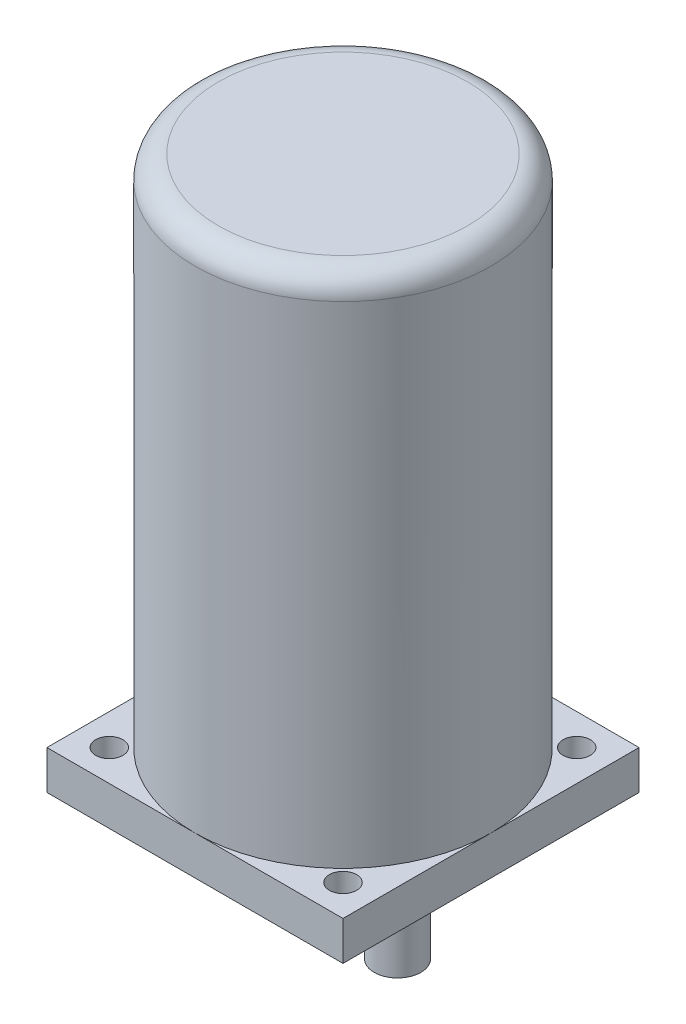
ISO-10303-21;
HEADER;
FILE_DESCRIPTION(('STEP AP214'),'2;1');
FILE_NAME('part.step','',(''),(''),'','','');
FILE_SCHEMA(('AUTOMOTIVE_DESIGN { 1 0 10303 214 1 1 1 1 }'));
ENDSEC;
DATA;
#1=APPLICATION_CONTEXT('core data for automotive mechanical design processes');
#2=APPLICATION_PROTOCOL_DEFINITION('international standard','automotive_design',2000,#1);
#3=PRODUCT_CONTEXT('',#1,'mechanical');
#4=PRODUCT('Part','Part','',(#3));
#5=PRODUCT_RELATED_PRODUCT_CATEGORY('part','',(#4));
#6=PRODUCT_DEFINITION_FORMATION('','',#4);
#7=PRODUCT_DEFINITION_CONTEXT('part definition',#1,'design');
#8=PRODUCT_DEFINITION('design','',#6,#7);
#9=PRODUCT_DEFINITION_SHAPE('','',#8);
#10=(LENGTH_UNIT() NAMED_UNIT(*) SI_UNIT(.MILLI.,.METRE.));
#11=(NAMED_UNIT(*) PLANE_ANGLE_UNIT() SI_UNIT($,.RADIAN.));
#12=(NAMED_UNIT(*) SI_UNIT($,.STERADIAN.) SOLID_ANGLE_UNIT());
#13=UNCERTAINTY_MEASURE_WITH_UNIT(LENGTH_MEASURE(1.E-05),#10,'distance_accuracy_value','');
#14=(GEOMETRIC_REPRESENTATION_CONTEXT(3) GLOBAL_UNCERTAINTY_ASSIGNED_CONTEXT((#13)) GLOBAL_UNIT_ASSIGNED_CONTEXT((#10,
#11,#12)) REPRESENTATION_CONTEXT('',''));
#15=CARTESIAN_POINT('',(0.,0.,0.));
#16=DIRECTION('',(0.,0.,1.));
#17=DIRECTION('',(1.,0.,0.));
#18=AXIS2_PLACEMENT_3D('',#15,#16,#17);
#19=CARTESIAN_POINT('',(0.,-22.,-6.99999999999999));
#20=DIRECTION('',(0.,-1.,0.));
#21=DIRECTION('',(0.,0.,-1.));
#22=AXIS2_PLACEMENT_3D('',#19,#20,#21);
#23=PLANE('',#22);
#24=CARTESIAN_POINT('',(0.,-22.,-6.99999999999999));
#25=DIRECTION('',(0.,1.,0.));
#26=DIRECTION('',(0.,0.,1.));
#27=AXIS2_PLACEMENT_3D('',#24,#25,#26);
#28=CIRCLE('',#27,3.);
#29=CARTESIAN_POINT('',(0.,-22.,-3.99999999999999));
#30=VERTEX_POINT('',#29);
#31=EDGE_CURVE('E202',#30,#30,#28,.T.);
#32=ORIENTED_EDGE('',*,*,#31,.F.);
#33=EDGE_LOOP('',(#32));
#34=FACE_BOUND('',#33,.T.);
#35=ADVANCED_FACE('F17',(#34),#23,.T.);
#36=CARTESIAN_POINT('',(0.,-22.,-6.99999999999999));
#37=DIRECTION('',(0.,1.,0.));
#38=DIRECTION('',(0.,0.,1.));
#39=AXIS2_PLACEMENT_3D('',#36,#37,#38);
#40=CYLINDRICAL_SURFACE('',#39,3.);
#41=CARTESIAN_POINT('',(0.,-7.,-6.99999999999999));
#42=DIRECTION('',(0.,1.,0.));
#43=DIRECTION('',(0.,0.,1.));
#44=AXIS2_PLACEMENT_3D('',#41,#42,#43);
#45=CIRCLE('',#44,3.);
#46=CARTESIAN_POINT('',(0.,-7.,-3.99999999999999));
#47=VERTEX_POINT('',#46);
#48=EDGE_CURVE('E200',#47,#47,#45,.T.);
#49=ORIENTED_EDGE('',*,*,#48,.F.);
#50=EDGE_LOOP('',(#49));
#51=FACE_BOUND('',#50,.T.);
#52=ORIENTED_EDGE('',*,*,#31,.T.);
#53=EDGE_LOOP('',(#52));
#54=FACE_BOUND('',#53,.T.);
#55=ADVANCED_FACE('F206',(#51,#54),#40,.T.);
#56=CARTESIAN_POINT('',(0.,-7.,-6.99999999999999));
#57=DIRECTION('',(0.,-1.,0.));
#58=DIRECTION('',(0.,0.,-1.));
#59=AXIS2_PLACEMENT_3D('',#56,#57,#58);
#60=PLANE('',#59);
#61=ORIENTED_EDGE('',*,*,#48,.T.);
#62=EDGE_LOOP('',(#61));
#63=FACE_BOUND('',#62,.T.);
#64=CARTESIAN_POINT('',(0.,-7.,-6.99999999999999));
#65=DIRECTION('',(0.,1.,0.));
#66=DIRECTION('',(0.,0.,1.));
#67=AXIS2_PLACEMENT_3D('',#64,#65,#66);
#68=CIRCLE('',#67,6.);
#69=CARTESIAN_POINT('',(0.,-7.,-0.999999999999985));
#70=VERTEX_POINT('',#69);
#71=EDGE_CURVE('E197',#70,#70,#68,.T.);
#72=ORIENTED_EDGE('',*,*,#71,.F.);
#73=EDGE_LOOP('',(#72));
#74=FACE_BOUND('',#73,.T.);
#75=ADVANCED_FACE('F213',(#63,#74),#60,.T.);
#76=CARTESIAN_POINT('',(0.,-7.,-6.99999999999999));
#77=DIRECTION('',(0.,1.,0.));
#78=DIRECTION('',(0.,0.,1.));
#79=AXIS2_PLACEMENT_3D('',#76,#77,#78);
#80=CYLINDRICAL_SURFACE('',#79,6.);
#81=ORIENTED_EDGE('',*,*,#71,.T.);
#82=EDGE_LOOP('',(#81));
#83=FACE_BOUND('',#82,.T.);
#84=CARTESIAN_POINT('',(0.,0.,-6.99999999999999));
#85=DIRECTION('',(0.,1.,0.));
#86=DIRECTION('',(0.,0.,1.));
#87=AXIS2_PLACEMENT_3D('',#84,#85,#86);
#88=CIRCLE('',#87,6.);
#89=CARTESIAN_POINT('',(0.,0.,-0.999999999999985));
#90=VERTEX_POINT('',#89);
#91=EDGE_CURVE('E194',#90,#90,#88,.F.);
#92=ORIENTED_EDGE('',*,*,#91,.T.);
#93=EDGE_LOOP('',(#92));
#94=FACE_BOUND('',#93,.T.);
#95=ADVANCED_FACE('F259',(#83,#94),#80,.T.);
#96=CARTESIAN_POINT('',(0.,0.,0.));
#97=DIRECTION('',(0.,1.,0.));
#98=DIRECTION('',(0.,0.,1.));
#99=AXIS2_PLACEMENT_3D('',#96,#97,#98);
#100=PLANE('',#99);
#101=ORIENTED_EDGE('',*,*,#91,.F.);
#102=EDGE_LOOP('',(#101));
#103=FACE_BOUND('',#102,.T.);
#104=DIRECTION('',(-1.,0.,0.));
#105=VECTOR('',#104,1.);
#106=CARTESIAN_POINT('',(-19.,0.,19.));
#107=LINE('',#106,#105);
#108=CARTESIAN_POINT('',(19.,0.,19.));
#109=VERTEX_POINT('',#108);
#110=CARTESIAN_POINT('',(-19.,0.,19.));
#111=VERTEX_POINT('',#110);
#112=EDGE_CURVE('E175',#109,#111,#107,.T.);
#113=ORIENTED_EDGE('',*,*,#112,.T.);
#114=DIRECTION('',(0.,0.,-1.));
#115=VECTOR('',#114,1.);
#116=CARTESIAN_POINT('',(-19.,0.,-19.));
#117=LINE('',#116,#115);
#118=CARTESIAN_POINT('',(-19.,0.,-19.));
#119=VERTEX_POINT('',#118);
#120=EDGE_CURVE('E187',#111,#119,#117,.T.);
#121=ORIENTED_EDGE('',*,*,#120,.T.);
#122=DIRECTION('',(1.,0.,0.));
#123=VECTOR('',#122,1.);
#124=CARTESIAN_POINT('',(-19.,0.,-19.));
#125=LINE('',#124,#123);
#126=CARTESIAN_POINT('',(19.,0.,-19.));
#127=VERTEX_POINT('',#126);
#128=EDGE_CURVE('E83',#119,#127,#125,.T.);
#129=ORIENTED_EDGE('',*,*,#128,.T.);
#130=DIRECTION('',(0.,0.,1.));
#131=VECTOR('',#130,1.);
#132=CARTESIAN_POINT('',(19.,0.,-19.));
#133=LINE('',#132,#131);
#134=EDGE_CURVE('E165',#127,#109,#133,.T.);
#135=ORIENTED_EDGE('',*,*,#134,.T.);
#136=EDGE_LOOP('',(#113,#121,#129,#135));
#137=FACE_BOUND('',#136,.T.);
#138=CARTESIAN_POINT('',(-15.,0.,15.));
#139=DIRECTION('',(0.,-1.,0.));
#140=DIRECTION('',(0.,0.,-1.));
#141=AXIS2_PLACEMENT_3D('',#138,#139,#140);
#142=CIRCLE('',#141,1.75);
#143=CARTESIAN_POINT('',(-15.,0.,13.25));
#144=VERTEX_POINT('',#143);
#145=EDGE_CURVE('E188',#144,#144,#142,.F.);
#146=ORIENTED_EDGE('',*,*,#145,.T.);
#147=EDGE_LOOP('',(#146));
#148=FACE_BOUND('',#147,.T.);
#149=CARTESIAN_POINT('',(-15.,0.,-15.));
#150=DIRECTION('',(0.,-1.,0.));
#151=DIRECTION('',(0.,0.,-1.));
#152=AXIS2_PLACEMENT_3D('',#149,#150,#151);
#153=CIRCLE('',#152,1.75);
#154=CARTESIAN_POINT('',(-15.,0.,-16.75));
#155=VERTEX_POINT('',#154);
#156=EDGE_CURVE('E191',#155,#155,#153,.F.);
#157=ORIENTED_EDGE('',*,*,#156,.T.);
#158=EDGE_LOOP('',(#157));
#159=FACE_BOUND('',#158,.T.);
#160=CARTESIAN_POINT('',(15.,0.,15.));
#161=DIRECTION('',(0.,-1.,0.));
#162=DIRECTION('',(0.,0.,-1.));
#163=AXIS2_PLACEMENT_3D('',#160,#161,#162);
#164=CIRCLE('',#163,1.75);
#165=CARTESIAN_POINT('',(15.,0.,13.25));
#166=VERTEX_POINT('',#165);
#167=EDGE_CURVE('E184',#166,#166,#164,.F.);
#168=ORIENTED_EDGE('',*,*,#167,.T.);
#169=EDGE_LOOP('',(#168));
#170=FACE_BOUND('',#169,.T.);
#171=CARTESIAN_POINT('',(15.,0.,-15.));
#172=DIRECTION('',(0.,-1.,0.));
#173=DIRECTION('',(0.,0.,-1.));
#174=AXIS2_PLACEMENT_3D('',#171,#172,#173);
#175=CIRCLE('',#174,1.75);
#176=CARTESIAN_POINT('',(15.,0.,-16.75));
#177=VERTEX_POINT('',#176);
#178=EDGE_CURVE('E168',#177,#177,#175,.F.);
#179=ORIENTED_EDGE('',*,*,#178,.T.);
#180=EDGE_LOOP('',(#179));
#181=FACE_BOUND('',#180,.T.);
#182=ADVANCED_FACE('F256',(#103,#137,#148,#159,#170,#181),#100,.F.);
#183=CARTESIAN_POINT('',(-15.,71.,-15.));
#184=DIRECTION('',(0.,-1.,0.));
#185=DIRECTION('',(0.,0.,-1.));
#186=AXIS2_PLACEMENT_3D('',#183,#184,#185);
#187=CYLINDRICAL_SURFACE('',#186,1.75);
#188=CARTESIAN_POINT('',(-15.,5.,-15.));
#189=DIRECTION('',(0.,-1.,0.));
#190=DIRECTION('',(0.,0.,-1.));
#191=AXIS2_PLACEMENT_3D('',#188,#189,#190);
#192=CIRCLE('',#191,1.75);
#193=CARTESIAN_POINT('',(-15.,5.,-16.75));
#194=VERTEX_POINT('',#193);
#195=EDGE_CURVE('E82',#194,#194,#192,.T.);
#196=ORIENTED_EDGE('',*,*,#195,.F.);
#197=EDGE_LOOP('',(#196));
#198=FACE_BOUND('',#197,.T.);
#199=ORIENTED_EDGE('',*,*,#156,.F.);
#200=EDGE_LOOP('',(#199));
#201=FACE_BOUND('',#200,.T.);
#202=ADVANCED_FACE('F253',(#198,#201),#187,.F.);
#203=CARTESIAN_POINT('',(-15.,71.,15.));
#204=DIRECTION('',(0.,-1.,0.));
#205=DIRECTION('',(0.,0.,-1.));
#206=AXIS2_PLACEMENT_3D('',#203,#204,#205);
#207=CYLINDRICAL_SURFACE('',#206,1.75);
#208=CARTESIAN_POINT('',(-15.,5.,15.));
#209=DIRECTION('',(0.,-1.,0.));
#210=DIRECTION('',(0.,0.,-1.));
#211=AXIS2_PLACEMENT_3D('',#208,#209,#210);
#212=CIRCLE('',#211,1.75);
#213=CARTESIAN_POINT('',(-15.,5.,13.25));
#214=VERTEX_POINT('',#213);
#215=EDGE_CURVE('E151',#214,#214,#212,.T.);
#216=ORIENTED_EDGE('',*,*,#215,.F.);
#217=EDGE_LOOP('',(#216));
#218=FACE_BOUND('',#217,.T.);
#219=ORIENTED_EDGE('',*,*,#145,.F.);
#220=EDGE_LOOP('',(#219));
#221=FACE_BOUND('',#220,.T.);
#222=ADVANCED_FACE('F250',(#218,#221),#207,.F.);
#223=CARTESIAN_POINT('',(-19.,5.,-19.));
#224=DIRECTION('',(1.,0.,0.));
#225=DIRECTION('',(0.,0.,-1.));
#226=AXIS2_PLACEMENT_3D('',#223,#224,#225);
#227=PLANE('',#226);
#228=DIRECTION('',(0.,1.,0.));
#229=VECTOR('',#228,1.);
#230=CARTESIAN_POINT('',(-19.,5.,19.));
#231=LINE('',#230,#229);
#232=CARTESIAN_POINT('',(-19.,5.,19.));
#233=VERTEX_POINT('',#232);
#234=EDGE_CURVE('E122',#111,#233,#231,.T.);
#235=ORIENTED_EDGE('',*,*,#234,.T.);
#236=DIRECTION('',(0.,0.,1.));
#237=VECTOR('',#236,1.);
#238=CARTESIAN_POINT('',(-19.,5.,0.));
#239=LINE('',#238,#237);
#240=CARTESIAN_POINT('',(-19.,5.,0.));
#241=VERTEX_POINT('',#240);
#242=EDGE_CURVE('E146',#241,#233,#239,.T.);
#243=ORIENTED_EDGE('',*,*,#242,.F.);
#244=DIRECTION('',(0.,0.,1.));
#245=VECTOR('',#244,1.);
#246=CARTESIAN_POINT('',(-19.,5.,0.));
#247=LINE('',#246,#245);
#248=CARTESIAN_POINT('',(-19.,5.,-19.));
#249=VERTEX_POINT('',#248);
#250=EDGE_CURVE('E154',#249,#241,#247,.T.);
#251=ORIENTED_EDGE('',*,*,#250,.F.);
#252=DIRECTION('',(0.,1.,0.));
#253=VECTOR('',#252,1.);
#254=CARTESIAN_POINT('',(-19.,5.,-19.));
#255=LINE('',#254,#253);
#256=EDGE_CURVE('E164',#249,#119,#255,.F.);
#257=ORIENTED_EDGE('',*,*,#256,.T.);
#258=ORIENTED_EDGE('',*,*,#120,.F.);
#259=EDGE_LOOP('',(#235,#243,#251,#257,#258));
#260=FACE_BOUND('',#259,.T.);
#261=ADVANCED_FACE('F107',(#260),#227,.F.);
#262=CARTESIAN_POINT('',(0.,71.,0.));
#263=DIRECTION('',(0.,1.,0.));
#264=DIRECTION('',(0.,0.,1.));
#265=AXIS2_PLACEMENT_3D('',#262,#263,#264);
#266=PLANE('',#265);
#267=CARTESIAN_POINT('',(0.,71.,0.));
#268=DIRECTION('',(0.,-1.,0.));
#269=DIRECTION('',(0.,0.,-1.));
#270=AXIS2_PLACEMENT_3D('',#267,#268,#269);
#271=CIRCLE('',#270,16.);
#272=CARTESIAN_POINT('',(0.,71.,-16.));
#273=VERTEX_POINT('',#272);
#274=CARTESIAN_POINT('',(0.,71.,16.));
#275=VERTEX_POINT('',#274);
#276=EDGE_CURVE('E78',#273,#275,#271,.T.);
#277=ORIENTED_EDGE('',*,*,#276,.F.);
#278=CARTESIAN_POINT('',(0.,71.,0.));
#279=DIRECTION('',(0.,-1.,0.));
#280=DIRECTION('',(0.,0.,1.));
#281=AXIS2_PLACEMENT_3D('',#278,#279,#280);
#282=CIRCLE('',#281,16.);
#283=EDGE_CURVE('E74',#275,#273,#282,.T.);
#284=ORIENTED_EDGE('',*,*,#283,.F.);
#285=EDGE_LOOP('',(#277,#284));
#286=FACE_BOUND('',#285,.T.);
#287=ADVANCED_FACE('F86',(#286),#266,.T.);
#288=CARTESIAN_POINT('',(15.,71.,15.));
#289=DIRECTION('',(0.,-1.,0.));
#290=DIRECTION('',(0.,0.,-1.));
#291=AXIS2_PLACEMENT_3D('',#288,#289,#290);
#292=CYLINDRICAL_SURFACE('',#291,1.75);
#293=CARTESIAN_POINT('',(15.,5.,15.));
#294=DIRECTION('',(0.,-1.,0.));
#295=DIRECTION('',(0.,0.,-1.));
#296=AXIS2_PLACEMENT_3D('',#293,#294,#295);
#297=CIRCLE('',#296,1.75);
#298=CARTESIAN_POINT('',(15.,5.,13.25));
#299=VERTEX_POINT('',#298);
#300=EDGE_CURVE('E87',#299,#299,#297,.T.);
#301=ORIENTED_EDGE('',*,*,#300,.F.);
#302=EDGE_LOOP('',(#301));
#303=FACE_BOUND('',#302,.T.);
#304=ORIENTED_EDGE('',*,*,#167,.F.);
#305=EDGE_LOOP('',(#304));
#306=FACE_BOUND('',#305,.T.);
#307=ADVANCED_FACE('F106',(#303,#306),#292,.F.);
#308=CARTESIAN_POINT('',(-19.,5.,19.));
#309=DIRECTION('',(0.,0.,-1.));
#310=DIRECTION('',(-1.,0.,0.));
#311=AXIS2_PLACEMENT_3D('',#308,#309,#310);
#312=PLANE('',#311);
#313=DIRECTION('',(0.,1.,0.));
#314=VECTOR('',#313,1.);
#315=CARTESIAN_POINT('',(19.,5.,19.));
#316=LINE('',#315,#314);
#317=CARTESIAN_POINT('',(19.,5.,19.));
#318=VERTEX_POINT('',#317);
#319=EDGE_CURVE('E167',#109,#318,#316,.T.);
#320=ORIENTED_EDGE('',*,*,#319,.T.);
#321=DIRECTION('',(1.,0.,0.));
#322=VECTOR('',#321,1.);
#323=CARTESIAN_POINT('',(0.,5.,19.));
#324=LINE('',#323,#322);
#325=CARTESIAN_POINT('',(0.,5.,19.));
#326=VERTEX_POINT('',#325);
#327=EDGE_CURVE('E245',#326,#318,#324,.T.);
#328=ORIENTED_EDGE('',*,*,#327,.F.);
#329=DIRECTION('',(1.,0.,0.));
#330=VECTOR('',#329,1.);
#331=CARTESIAN_POINT('',(0.,5.,19.));
#332=LINE('',#331,#330);
#333=EDGE_CURVE('E88',#233,#326,#332,.T.);
#334=ORIENTED_EDGE('',*,*,#333,.F.);
#335=ORIENTED_EDGE('',*,*,#234,.F.);
#336=ORIENTED_EDGE('',*,*,#112,.F.);
#337=EDGE_LOOP('',(#320,#328,#334,#335,#336));
#338=FACE_BOUND('',#337,.T.);
#339=ADVANCED_FACE('F267',(#338),#312,.F.);
#340=CARTESIAN_POINT('',(15.,71.,-15.));
#341=DIRECTION('',(0.,-1.,0.));
#342=DIRECTION('',(0.,0.,-1.));
#343=AXIS2_PLACEMENT_3D('',#340,#341,#342);
#344=CYLINDRICAL_SURFACE('',#343,1.75);
#345=CARTESIAN_POINT('',(15.,5.,-15.));
#346=DIRECTION('',(0.,-1.,0.));
#347=DIRECTION('',(0.,0.,-1.));
#348=AXIS2_PLACEMENT_3D('',#345,#346,#347);
#349=CIRCLE('',#348,1.75);
#350=CARTESIAN_POINT('',(15.,5.,-16.75));
#351=VERTEX_POINT('',#350);
#352=EDGE_CURVE('E239',#351,#351,#349,.T.);
#353=ORIENTED_EDGE('',*,*,#352,.F.);
#354=EDGE_LOOP('',(#353));
#355=FACE_BOUND('',#354,.T.);
#356=ORIENTED_EDGE('',*,*,#178,.F.);
#357=EDGE_LOOP('',(#356));
#358=FACE_BOUND('',#357,.T.);
#359=ADVANCED_FACE('F272',(#355,#358),#344,.F.);
#360=CARTESIAN_POINT('',(19.,5.,-19.));
#361=DIRECTION('',(-1.,0.,0.));
#362=DIRECTION('',(0.,0.,1.));
#363=AXIS2_PLACEMENT_3D('',#360,#361,#362);
#364=PLANE('',#363);
#365=DIRECTION('',(0.,1.,0.));
#366=VECTOR('',#365,1.);
#367=CARTESIAN_POINT('',(19.,5.,-19.));
#368=LINE('',#367,#366);
#369=CARTESIAN_POINT('',(19.,5.,-19.));
#370=VERTEX_POINT('',#369);
#371=EDGE_CURVE('E162',#127,#370,#368,.T.);
#372=ORIENTED_EDGE('',*,*,#371,.T.);
#373=DIRECTION('',(0.,0.,1.));
#374=VECTOR('',#373,1.);
#375=CARTESIAN_POINT('',(19.,5.,0.));
#376=LINE('',#375,#374);
#377=CARTESIAN_POINT('',(19.,5.,0.));
#378=VERTEX_POINT('',#377);
#379=EDGE_CURVE('E242',#378,#370,#376,.F.);
#380=ORIENTED_EDGE('',*,*,#379,.F.);
#381=DIRECTION('',(0.,0.,1.));
#382=VECTOR('',#381,1.);
#383=CARTESIAN_POINT('',(19.,5.,0.));
#384=LINE('',#383,#382);
#385=EDGE_CURVE('E243',#318,#378,#384,.F.);
#386=ORIENTED_EDGE('',*,*,#385,.F.);
#387=ORIENTED_EDGE('',*,*,#319,.F.);
#388=ORIENTED_EDGE('',*,*,#134,.F.);
#389=EDGE_LOOP('',(#372,#380,#386,#387,#388));
#390=FACE_BOUND('',#389,.T.);
#391=ADVANCED_FACE('F312',(#390),#364,.F.);
#392=CARTESIAN_POINT('',(-19.,5.,-19.));
#393=DIRECTION('',(0.,0.,1.));
#394=DIRECTION('',(1.,0.,0.));
#395=AXIS2_PLACEMENT_3D('',#392,#393,#394);
#396=PLANE('',#395);
#397=ORIENTED_EDGE('',*,*,#256,.F.);
#398=DIRECTION('',(1.,0.,0.));
#399=VECTOR('',#398,1.);
#400=CARTESIAN_POINT('',(0.,5.,-19.));
#401=LINE('',#400,#399);
#402=CARTESIAN_POINT('',(0.,5.,-19.));
#403=VERTEX_POINT('',#402);
#404=EDGE_CURVE('E36',#403,#249,#401,.F.);
#405=ORIENTED_EDGE('',*,*,#404,.F.);
#406=DIRECTION('',(1.,0.,0.));
#407=VECTOR('',#406,1.);
#408=CARTESIAN_POINT('',(0.,5.,-19.));
#409=LINE('',#408,#407);
#410=EDGE_CURVE('E236',#370,#403,#409,.F.);
#411=ORIENTED_EDGE('',*,*,#410,.F.);
#412=ORIENTED_EDGE('',*,*,#371,.F.);
#413=ORIENTED_EDGE('',*,*,#128,.F.);
#414=EDGE_LOOP('',(#397,#405,#411,#412,#413));
#415=FACE_BOUND('',#414,.T.);
#416=ADVANCED_FACE('F313',(#415),#396,.F.);
#417=CARTESIAN_POINT('',(0.,5.,0.));
#418=DIRECTION('',(0.,1.,0.));
#419=DIRECTION('',(0.,0.,1.));
#420=AXIS2_PLACEMENT_3D('',#417,#418,#419);
#421=PLANE('',#420);
#422=ORIENTED_EDGE('',*,*,#404,.T.);
#423=ORIENTED_EDGE('',*,*,#250,.T.);
#424=CARTESIAN_POINT('',(0.,5.,0.));
#425=DIRECTION('',(0.,-1.,0.));
#426=DIRECTION('',(0.,0.,-1.));
#427=AXIS2_PLACEMENT_3D('',#424,#425,#426);
#428=CIRCLE('',#427,19.);
#429=EDGE_CURVE('E234',#403,#241,#428,.F.);
#430=ORIENTED_EDGE('',*,*,#429,.F.);
#431=EDGE_LOOP('',(#422,#423,#430));
#432=FACE_BOUND('',#431,.T.);
#433=ORIENTED_EDGE('',*,*,#195,.T.);
#434=EDGE_LOOP('',(#433));
#435=FACE_BOUND('',#434,.T.);
#436=ADVANCED_FACE('F300',(#432,#435),#421,.T.);
#437=CARTESIAN_POINT('',(0.,5.,0.));
#438=DIRECTION('',(0.,1.,0.));
#439=DIRECTION('',(0.,0.,1.));
#440=AXIS2_PLACEMENT_3D('',#437,#438,#439);
#441=PLANE('',#440);
#442=ORIENTED_EDGE('',*,*,#242,.T.);
#443=ORIENTED_EDGE('',*,*,#333,.T.);
#444=CARTESIAN_POINT('',(0.,5.,0.));
#445=DIRECTION('',(0.,-1.,0.));
#446=DIRECTION('',(0.,0.,-1.));
#447=AXIS2_PLACEMENT_3D('',#444,#445,#446);
#448=CIRCLE('',#447,19.);
#449=EDGE_CURVE('E229',#241,#326,#448,.F.);
#450=ORIENTED_EDGE('',*,*,#449,.F.);
#451=EDGE_LOOP('',(#442,#443,#450));
#452=FACE_BOUND('',#451,.T.);
#453=ORIENTED_EDGE('',*,*,#215,.T.);
#454=EDGE_LOOP('',(#453));
#455=FACE_BOUND('',#454,.T.);
#456=ADVANCED_FACE('F135',(#452,#455),#441,.T.);
#457=CARTESIAN_POINT('',(0.,68.,0.));
#458=DIRECTION('',(0.,1.,0.));
#459=DIRECTION('',(0.,0.,1.));
#460=AXIS2_PLACEMENT_3D('',#457,#458,#459);
#461=TOROIDAL_SURFACE('',#460,16.,3.);
#462=ORIENTED_EDGE('',*,*,#283,.T.);
#463=ORIENTED_EDGE('',*,*,#276,.T.);
#464=EDGE_LOOP('',(#462,#463));
#465=FACE_BOUND('',#464,.T.);
#466=CARTESIAN_POINT('',(0.,68.,0.));
#467=DIRECTION('',(0.,-1.,0.));
#468=DIRECTION('',(0.,0.,-1.));
#469=AXIS2_PLACEMENT_3D('',#466,#467,#468);
#470=CIRCLE('',#469,19.);
#471=CARTESIAN_POINT('',(0.,68.,-19.));
#472=VERTEX_POINT('',#471);
#473=EDGE_CURVE('E142',#472,#472,#470,.T.);
#474=ORIENTED_EDGE('',*,*,#473,.F.);
#475=EDGE_LOOP('',(#474));
#476=FACE_BOUND('',#475,.T.);
#477=ADVANCED_FACE('F76',(#465,#476),#461,.T.);
#478=CARTESIAN_POINT('',(0.,5.,0.));
#479=DIRECTION('',(0.,1.,0.));
#480=DIRECTION('',(0.,0.,1.));
#481=AXIS2_PLACEMENT_3D('',#478,#479,#480);
#482=PLANE('',#481);
#483=ORIENTED_EDGE('',*,*,#327,.T.);
#484=ORIENTED_EDGE('',*,*,#385,.T.);
#485=CARTESIAN_POINT('',(0.,5.,0.));
#486=DIRECTION('',(0.,-1.,0.));
#487=DIRECTION('',(0.,0.,-1.));
#488=AXIS2_PLACEMENT_3D('',#485,#486,#487);
#489=CIRCLE('',#488,19.);
#490=EDGE_CURVE('E28',#326,#378,#489,.F.);
#491=ORIENTED_EDGE('',*,*,#490,.F.);
#492=EDGE_LOOP('',(#483,#484,#491));
#493=FACE_BOUND('',#492,.T.);
#494=ORIENTED_EDGE('',*,*,#300,.T.);
#495=EDGE_LOOP('',(#494));
#496=FACE_BOUND('',#495,.T.);
#497=ADVANCED_FACE('F134',(#493,#496),#482,.T.);
#498=CARTESIAN_POINT('',(0.,5.,0.));
#499=DIRECTION('',(0.,1.,0.));
#500=DIRECTION('',(0.,0.,1.));
#501=AXIS2_PLACEMENT_3D('',#498,#499,#500);
#502=PLANE('',#501);
#503=ORIENTED_EDGE('',*,*,#379,.T.);
#504=ORIENTED_EDGE('',*,*,#410,.T.);
#505=CARTESIAN_POINT('',(0.,5.,0.));
#506=DIRECTION('',(0.,-1.,0.));
#507=DIRECTION('',(0.,0.,-1.));
#508=AXIS2_PLACEMENT_3D('',#505,#506,#507);
#509=CIRCLE('',#508,19.);
#510=EDGE_CURVE('E11',#378,#403,#509,.F.);
#511=ORIENTED_EDGE('',*,*,#510,.F.);
#512=EDGE_LOOP('',(#503,#504,#511));
#513=FACE_BOUND('',#512,.T.);
#514=ORIENTED_EDGE('',*,*,#352,.T.);
#515=EDGE_LOOP('',(#514));
#516=FACE_BOUND('',#515,.T.);
#517=ADVANCED_FACE('F217',(#513,#516),#502,.T.);
#518=CARTESIAN_POINT('',(0.,71.,0.));
#519=DIRECTION('',(0.,-1.,0.));
#520=DIRECTION('',(0.,0.,-1.));
#521=AXIS2_PLACEMENT_3D('',#518,#519,#520);
#522=CYLINDRICAL_SURFACE('',#521,19.);
#523=ORIENTED_EDGE('',*,*,#449,.T.);
#524=ORIENTED_EDGE('',*,*,#490,.T.);
#525=ORIENTED_EDGE('',*,*,#510,.T.);
#526=ORIENTED_EDGE('',*,*,#429,.T.);
#527=EDGE_LOOP('',(#523,#524,#525,#526));
#528=FACE_BOUND('',#527,.T.);
#529=ORIENTED_EDGE('',*,*,#473,.T.);
#530=EDGE_LOOP('',(#529));
#531=FACE_BOUND('',#530,.T.);
#532=ADVANCED_FACE('F215',(#528,#531),#522,.T.);
#533=CLOSED_SHELL('',(#35,#55,#75,#95,#182,#202,#222,#261,#287,#307,#339,#359,#391,#416,#436,
#456,#477,#497,#517,#532));
#534=MANIFOLD_SOLID_BREP('B1',#533);
#535=ADVANCED_BREP_SHAPE_REPRESENTATION('',(#18,#534),#14);
#536=SHAPE_DEFINITION_REPRESENTATION(#9,#535);
ENDSEC;
END-ISO-10303-21;
